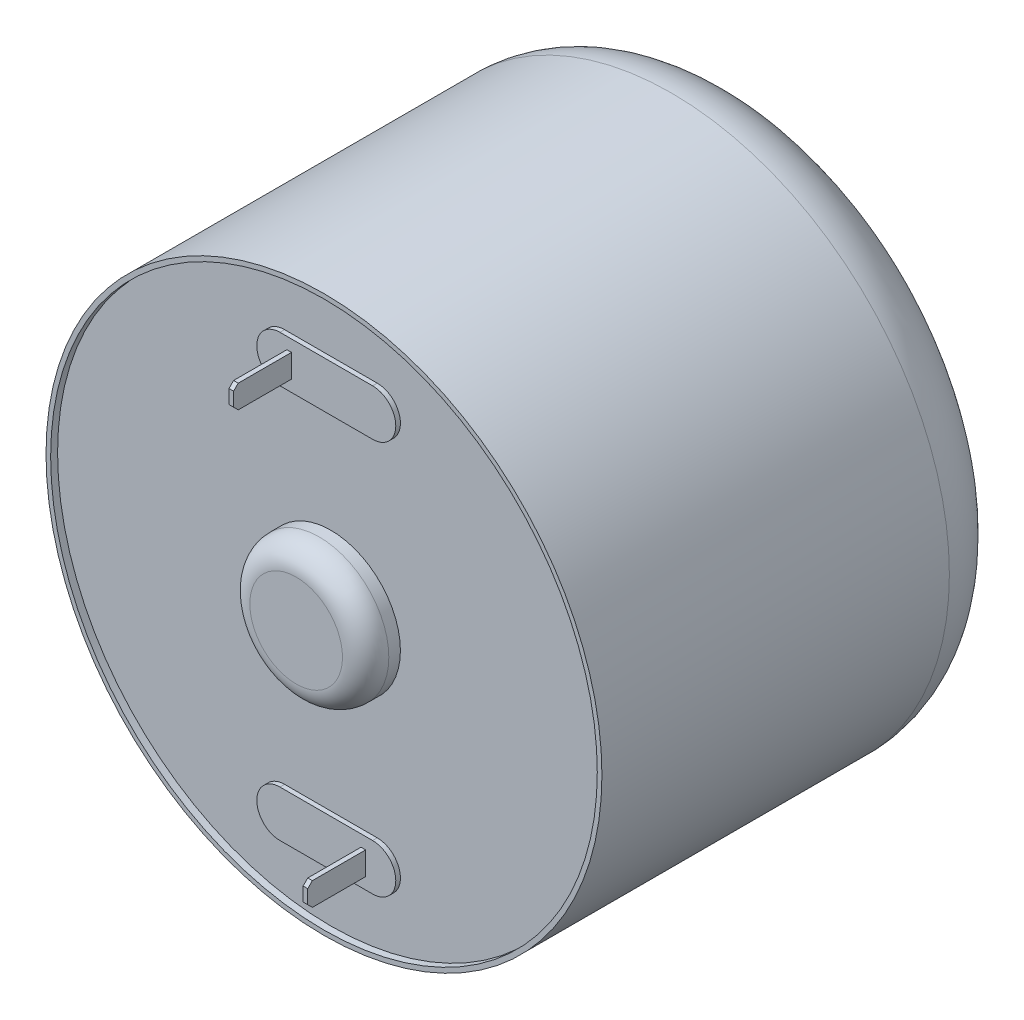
from build123d import *

# Parameters (mm, degrees)
EXTRUSION1_DEPTH                          = 18
CONG_1_R                                  = 3
ESQUISSE2_R                               = 11.8
ENL_V_MAT_EXTRU_1_DEPTH                   = 0.3
ESQUISSE3_R                               = 3
EXTRUSION2_DEPTH                          = 1.5
CONG_2_R                                  = 1
ESQUISSE4_R                               = 2
EXTRUSION3_DEPTH                          = 0.2
ESQUISSE5_W                               = 0.2
ESQUISSE5_H                               = 1
EXTRUSION4_DEPTH                          = 2.5
CHANFREIN1_SIZE                           = 0.2
R_P_TITION_CIRCULAIRE1_COUNT              = 2
CHANFREIN1_OF_R_P_TITION_CIRCULAIRE1_SIZE = 0.2


with BuildPart() as part:
    # Esquisse1 → Extrusion1 (new body)
    with BuildSketch(Plane.XY):
        with BuildLine():
            ThreePointArc((-23.825635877, 11.265422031), (-28.325635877, 1.897925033), (-23.825635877, -7.469571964))
            ThreePointArc((-23.825635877, -7.469571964), (-11.129483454, -8.918728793), (-4.325635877, 1.897925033))
            ThreePointArc((-4.325635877, 1.897925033), (-11.129483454, 12.71457886), (-23.825635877, 11.265422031))
        make_face()
    extrude(amount=EXTRUSION1_DEPTH)

    # Cong_1
    cong_1_edges = [part.edges().sort_by_distance(p)[0] for p in [
        (-28.325635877, 1.897925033, 0),
    ]]
    fillet(cong_1_edges, radius=CONG_1_R)

    # Esquisse2 → Enl_v. mat.-Extru.1 (cut)
    with BuildSketch(Plane.XY.offset(18)):
        with Locations((-16.325635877, 1.897925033)):
            Circle(ESQUISSE2_R)
    extrude(amount=-ENL_V_MAT_EXTRU_1_DEPTH, mode=Mode.SUBTRACT)

    # Esquisse3 → Extrusion2 (add)
    with BuildSketch(Plane.XY.offset(17.7)):
        with Locations((-16.325635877, 1.897925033)):
            Circle(ESQUISSE3_R)
    extrude(amount=EXTRUSION2_DEPTH)

    # Cong_2
    cong_2_edges = [part.edges().sort_by_distance(p)[0] for p in [
        (-19.325635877, 1.897925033, 19.2),
    ]]
    fillet(cong_2_edges, radius=CONG_2_R)

    # Esquisse4 → Extrusion3 (add)
    with BuildSketch(Plane.XY.offset(17.7)):
        with Locations((-16.325635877, 1.897925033)):
            Circle(ESQUISSE4_R)
        with BuildLine():
            Line((-18.325635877, 11.397925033), (-14.325635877, 11.397925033))
            ThreePointArc((-14.325635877, 11.397925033), (-13.325635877, 10.397925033), (-14.325635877, 9.397925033))
            Line((-14.325635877, 9.397925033), (-18.325635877, 9.397925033))
            ThreePointArc((-18.325635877, 9.397925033), (-19.325635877, 10.397925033), (-18.325635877, 11.397925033))
        make_face()
    extrusion3 = extrude(amount=EXTRUSION3_DEPTH)

    # Esquisse5 → Extrusion4 (add)
    with BuildSketch(Plane.XY.offset(17.9)):
        with Locations((-17.925635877, 10.397925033)):
            Rectangle(ESQUISSE5_W, ESQUISSE5_H)
    extrusion4 = extrude(amount=EXTRUSION4_DEPTH)

    # Chanfrein1
    chanfrein1_edges = [part.edges().sort_by_distance(p)[0] for p in [
        (-17.925635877, 9.897925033, 20.4),
        (-17.925635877, 10.897925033, 20.4),
    ]]
    chamfer(chanfrein1_edges, length=CHANFREIN1_SIZE)

    # R_p_tition circulaire1: Extrusion3, Extrusion4 ×2 about axis
    r_p_tition_circulaire1_axis = Axis((-16.325635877, 1.897925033, 0), (0, 0, 1))
    add([extrusion3.rotate(r_p_tition_circulaire1_axis, i * 360 / R_P_TITION_CIRCULAIRE1_COUNT) for i in range(1, R_P_TITION_CIRCULAIRE1_COUNT)])
    add([extrusion4.rotate(r_p_tition_circulaire1_axis, i * 360 / R_P_TITION_CIRCULAIRE1_COUNT) for i in range(1, R_P_TITION_CIRCULAIRE1_COUNT)])

    # Chanfrein1 of R_p_tition circulaire1
    chanfrein1_of_r_p_tition_circulaire1_edges = [part.edges().sort_by_distance(p)[0] for p in [
        (-14.725635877, -6.102074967, 20.4),
        (-14.725635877, -7.102074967, 20.4),
    ]]
    chamfer(chanfrein1_of_r_p_tition_circulaire1_edges, length=CHANFREIN1_OF_R_P_TITION_CIRCULAIRE1_SIZE)


solid = part.part
